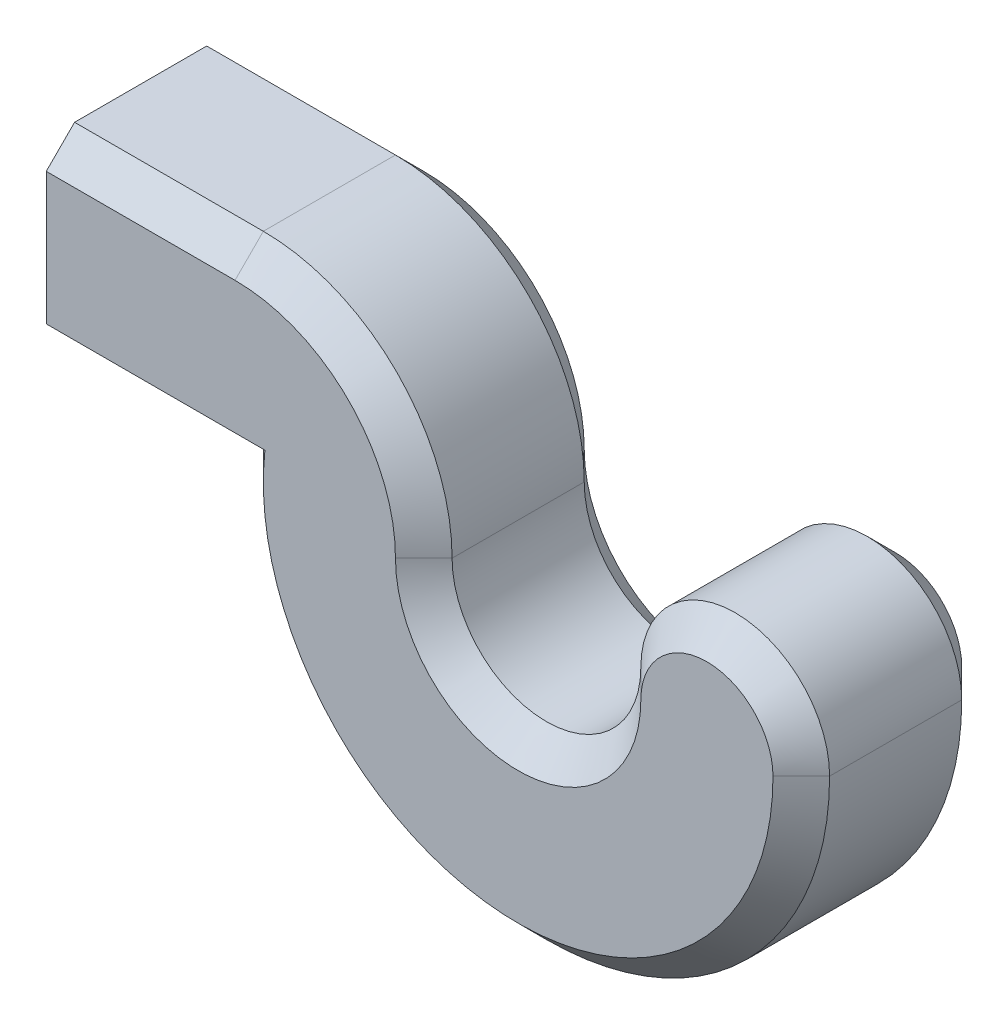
ISO-10303-21;
HEADER;
FILE_DESCRIPTION(('STEP AP214'),'2;1');
FILE_NAME('part.step','',(''),(''),'','','');
FILE_SCHEMA(('AUTOMOTIVE_DESIGN { 1 0 10303 214 1 1 1 1 }'));
ENDSEC;
DATA;
#1=APPLICATION_CONTEXT('core data for automotive mechanical design processes');
#2=APPLICATION_PROTOCOL_DEFINITION('international standard','automotive_design',2000,#1);
#3=PRODUCT_CONTEXT('',#1,'mechanical');
#4=PRODUCT('Part','Part','',(#3));
#5=PRODUCT_RELATED_PRODUCT_CATEGORY('part','',(#4));
#6=PRODUCT_DEFINITION_FORMATION('','',#4);
#7=PRODUCT_DEFINITION_CONTEXT('part definition',#1,'design');
#8=PRODUCT_DEFINITION('design','',#6,#7);
#9=PRODUCT_DEFINITION_SHAPE('','',#8);
#10=(LENGTH_UNIT() NAMED_UNIT(*) SI_UNIT(.MILLI.,.METRE.));
#11=(NAMED_UNIT(*) PLANE_ANGLE_UNIT() SI_UNIT($,.RADIAN.));
#12=(NAMED_UNIT(*) SI_UNIT($,.STERADIAN.) SOLID_ANGLE_UNIT());
#13=UNCERTAINTY_MEASURE_WITH_UNIT(LENGTH_MEASURE(1.E-05),#10,'distance_accuracy_value','');
#14=(GEOMETRIC_REPRESENTATION_CONTEXT(3) GLOBAL_UNCERTAINTY_ASSIGNED_CONTEXT((#13)) GLOBAL_UNIT_ASSIGNED_CONTEXT((#10,
#11,#12)) REPRESENTATION_CONTEXT('',''));
#15=CARTESIAN_POINT('',(0.,0.,0.));
#16=DIRECTION('',(0.,0.,1.));
#17=DIRECTION('',(1.,0.,0.));
#18=AXIS2_PLACEMENT_3D('',#15,#16,#17);
#19=CARTESIAN_POINT('',(0.,0.,2.));
#20=DIRECTION('',(0.,1.,0.));
#21=DIRECTION('',(0.,0.,1.));
#22=AXIS2_PLACEMENT_3D('',#19,#20,#21);
#23=PLANE('',#22);
#24=DIRECTION('',(0.,0.,-1.));
#25=VECTOR('',#24,1.);
#26=CARTESIAN_POINT('',(4.00000000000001,0.,2.));
#27=LINE('',#26,#25);
#28=CARTESIAN_POINT('',(4.00000000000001,0.,1.4));
#29=VERTEX_POINT('',#28);
#30=CARTESIAN_POINT('',(4.00000000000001,0.,-1.4));
#31=VERTEX_POINT('',#30);
#32=EDGE_CURVE('E151',#29,#31,#27,.T.);
#33=ORIENTED_EDGE('',*,*,#32,.F.);
#34=DIRECTION('',(-1.,0.,0.));
#35=VECTOR('',#34,1.);
#36=CARTESIAN_POINT('',(0.,0.,1.4));
#37=LINE('',#36,#35);
#38=CARTESIAN_POINT('',(0.,0.,1.4));
#39=VERTEX_POINT('',#38);
#40=EDGE_CURVE('E330',#29,#39,#37,.T.);
#41=ORIENTED_EDGE('',*,*,#40,.T.);
#42=DIRECTION('',(0.,0.,-1.));
#43=VECTOR('',#42,1.);
#44=CARTESIAN_POINT('',(0.,0.,2.));
#45=LINE('',#44,#43);
#46=CARTESIAN_POINT('',(0.,0.,-1.4));
#47=VERTEX_POINT('',#46);
#48=EDGE_CURVE('E161',#39,#47,#45,.T.);
#49=ORIENTED_EDGE('',*,*,#48,.T.);
#50=DIRECTION('',(1.,0.,0.));
#51=VECTOR('',#50,1.);
#52=CARTESIAN_POINT('',(0.,0.,-1.4));
#53=LINE('',#52,#51);
#54=EDGE_CURVE('E327',#47,#31,#53,.T.);
#55=ORIENTED_EDGE('',*,*,#54,.T.);
#56=EDGE_LOOP('',(#33,#41,#49,#55));
#57=FACE_BOUND('',#56,.T.);
#58=ADVANCED_FACE('F38',(#57),#23,.F.);
#59=CARTESIAN_POINT('',(10.,0.,2.));
#60=DIRECTION('',(0.,0.,-1.));
#61=DIRECTION('',(-1.,0.,0.));
#62=AXIS2_PLACEMENT_3D('',#59,#60,#61);
#63=CYLINDRICAL_SURFACE('',#62,6.);
#64=DIRECTION('',(0.,0.,-1.));
#65=VECTOR('',#64,1.);
#66=CARTESIAN_POINT('',(16.,0.,2.));
#67=LINE('',#66,#65);
#68=CARTESIAN_POINT('',(16.,0.,1.4));
#69=VERTEX_POINT('',#68);
#70=CARTESIAN_POINT('',(16.,0.,-1.4));
#71=VERTEX_POINT('',#70);
#72=EDGE_CURVE('E313',#69,#71,#67,.T.);
#73=ORIENTED_EDGE('',*,*,#72,.F.);
#74=CARTESIAN_POINT('',(10.,0.,1.4));
#75=DIRECTION('',(0.,0.,1.));
#76=DIRECTION('',(1.,0.,0.));
#77=AXIS2_PLACEMENT_3D('',#74,#75,#76);
#78=CIRCLE('',#77,6.);
#79=EDGE_CURVE('E176',#69,#29,#78,.F.);
#80=ORIENTED_EDGE('',*,*,#79,.T.);
#81=ORIENTED_EDGE('',*,*,#32,.T.);
#82=CARTESIAN_POINT('',(10.,0.,-1.4));
#83=DIRECTION('',(0.,0.,1.));
#84=DIRECTION('',(1.,0.,0.));
#85=AXIS2_PLACEMENT_3D('',#82,#83,#84);
#86=CIRCLE('',#85,6.);
#87=EDGE_CURVE('E169',#31,#71,#86,.T.);
#88=ORIENTED_EDGE('',*,*,#87,.T.);
#89=EDGE_LOOP('',(#73,#80,#81,#88));
#90=FACE_BOUND('',#89,.T.);
#91=ADVANCED_FACE('F357',(#90),#63,.T.);
#92=CARTESIAN_POINT('',(14.,0.,2.));
#93=DIRECTION('',(0.,0.,-1.));
#94=DIRECTION('',(-1.,0.,0.));
#95=AXIS2_PLACEMENT_3D('',#92,#93,#94);
#96=CYLINDRICAL_SURFACE('',#95,2.);
#97=DIRECTION('',(0.,0.,-1.));
#98=VECTOR('',#97,1.);
#99=CARTESIAN_POINT('',(12.,0.,2.));
#100=LINE('',#99,#98);
#101=CARTESIAN_POINT('',(12.,0.,1.4));
#102=VERTEX_POINT('',#101);
#103=CARTESIAN_POINT('',(12.,0.,-1.4));
#104=VERTEX_POINT('',#103);
#105=EDGE_CURVE('E310',#102,#104,#100,.T.);
#106=ORIENTED_EDGE('',*,*,#105,.F.);
#107=CARTESIAN_POINT('',(14.,0.,1.4));
#108=DIRECTION('',(0.,0.,1.));
#109=DIRECTION('',(1.,0.,0.));
#110=AXIS2_PLACEMENT_3D('',#107,#108,#109);
#111=CIRCLE('',#110,2.);
#112=EDGE_CURVE('E180',#102,#69,#111,.F.);
#113=ORIENTED_EDGE('',*,*,#112,.T.);
#114=ORIENTED_EDGE('',*,*,#72,.T.);
#115=CARTESIAN_POINT('',(14.,0.,-1.4));
#116=DIRECTION('',(0.,0.,1.));
#117=DIRECTION('',(1.,0.,0.));
#118=AXIS2_PLACEMENT_3D('',#115,#116,#117);
#119=CIRCLE('',#118,2.);
#120=EDGE_CURVE('E178',#71,#104,#119,.T.);
#121=ORIENTED_EDGE('',*,*,#120,.T.);
#122=EDGE_LOOP('',(#106,#113,#114,#121));
#123=FACE_BOUND('',#122,.T.);
#124=ADVANCED_FACE('F361',(#123),#96,.T.);
#125=CARTESIAN_POINT('',(10.,0.,2.));
#126=DIRECTION('',(0.,0.,-1.));
#127=DIRECTION('',(-1.,0.,0.));
#128=AXIS2_PLACEMENT_3D('',#125,#126,#127);
#129=CYLINDRICAL_SURFACE('',#128,2.);
#130=DIRECTION('',(0.,0.,-1.));
#131=VECTOR('',#130,1.);
#132=CARTESIAN_POINT('',(8.00000000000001,0.,2.));
#133=LINE('',#132,#131);
#134=CARTESIAN_POINT('',(8.00000000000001,0.,1.4));
#135=VERTEX_POINT('',#134);
#136=CARTESIAN_POINT('',(8.00000000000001,0.,-1.4));
#137=VERTEX_POINT('',#136);
#138=EDGE_CURVE('E302',#135,#137,#133,.T.);
#139=ORIENTED_EDGE('',*,*,#138,.F.);
#140=CARTESIAN_POINT('',(10.,0.,1.4));
#141=DIRECTION('',(0.,0.,1.));
#142=DIRECTION('',(1.,0.,0.));
#143=AXIS2_PLACEMENT_3D('',#140,#141,#142);
#144=CIRCLE('',#143,2.);
#145=EDGE_CURVE('E184',#135,#102,#144,.T.);
#146=ORIENTED_EDGE('',*,*,#145,.T.);
#147=ORIENTED_EDGE('',*,*,#105,.T.);
#148=CARTESIAN_POINT('',(10.,0.,-1.4));
#149=DIRECTION('',(0.,0.,1.));
#150=DIRECTION('',(1.,0.,0.));
#151=AXIS2_PLACEMENT_3D('',#148,#149,#150);
#152=CIRCLE('',#151,2.);
#153=EDGE_CURVE('E182',#104,#137,#152,.F.);
#154=ORIENTED_EDGE('',*,*,#153,.T.);
#155=EDGE_LOOP('',(#139,#146,#147,#154));
#156=FACE_BOUND('',#155,.T.);
#157=ADVANCED_FACE('F379',(#156),#129,.F.);
#158=CARTESIAN_POINT('',(4.00000000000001,0.,2.));
#159=DIRECTION('',(0.,0.,-1.));
#160=DIRECTION('',(-1.,0.,0.));
#161=AXIS2_PLACEMENT_3D('',#158,#159,#160);
#162=CYLINDRICAL_SURFACE('',#161,4.);
#163=DIRECTION('',(0.,0.,-1.));
#164=VECTOR('',#163,1.);
#165=CARTESIAN_POINT('',(4.00000000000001,4.,2.));
#166=LINE('',#165,#164);
#167=CARTESIAN_POINT('',(4.00000000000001,4.,1.4));
#168=VERTEX_POINT('',#167);
#169=CARTESIAN_POINT('',(4.00000000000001,4.,-1.4));
#170=VERTEX_POINT('',#169);
#171=EDGE_CURVE('E298',#168,#170,#166,.T.);
#172=ORIENTED_EDGE('',*,*,#171,.F.);
#173=CARTESIAN_POINT('',(4.00000000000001,0.,1.4));
#174=DIRECTION('',(0.,0.,1.));
#175=DIRECTION('',(1.,0.,0.));
#176=AXIS2_PLACEMENT_3D('',#173,#174,#175);
#177=CIRCLE('',#176,4.);
#178=EDGE_CURVE('E188',#168,#135,#177,.F.);
#179=ORIENTED_EDGE('',*,*,#178,.T.);
#180=ORIENTED_EDGE('',*,*,#138,.T.);
#181=CARTESIAN_POINT('',(4.00000000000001,0.,-1.4));
#182=DIRECTION('',(0.,0.,1.));
#183=DIRECTION('',(1.,0.,0.));
#184=AXIS2_PLACEMENT_3D('',#181,#182,#183);
#185=CIRCLE('',#184,4.);
#186=EDGE_CURVE('E186',#137,#170,#185,.T.);
#187=ORIENTED_EDGE('',*,*,#186,.T.);
#188=EDGE_LOOP('',(#172,#179,#180,#187));
#189=FACE_BOUND('',#188,.T.);
#190=ADVANCED_FACE('F382',(#189),#162,.T.);
#191=CARTESIAN_POINT('',(0.,4.,2.));
#192=DIRECTION('',(0.,-1.,0.));
#193=DIRECTION('',(1.,0.,0.));
#194=AXIS2_PLACEMENT_3D('',#191,#192,#193);
#195=PLANE('',#194);
#196=DIRECTION('',(0.,0.,-1.));
#197=VECTOR('',#196,1.);
#198=CARTESIAN_POINT('',(0.,4.,2.));
#199=LINE('',#198,#197);
#200=CARTESIAN_POINT('',(0.,4.,1.4));
#201=VERTEX_POINT('',#200);
#202=CARTESIAN_POINT('',(0.,4.,-1.4));
#203=VERTEX_POINT('',#202);
#204=EDGE_CURVE('E296',#201,#203,#199,.T.);
#205=ORIENTED_EDGE('',*,*,#204,.F.);
#206=DIRECTION('',(1.,0.,0.));
#207=VECTOR('',#206,1.);
#208=CARTESIAN_POINT('',(4.00000000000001,4.,1.4));
#209=LINE('',#208,#207);
#210=EDGE_CURVE('E166',#201,#168,#209,.T.);
#211=ORIENTED_EDGE('',*,*,#210,.T.);
#212=ORIENTED_EDGE('',*,*,#171,.T.);
#213=DIRECTION('',(-1.,0.,0.));
#214=VECTOR('',#213,1.);
#215=CARTESIAN_POINT('',(0.,4.,-1.4));
#216=LINE('',#215,#214);
#217=EDGE_CURVE('E190',#170,#203,#216,.T.);
#218=ORIENTED_EDGE('',*,*,#217,.T.);
#219=EDGE_LOOP('',(#205,#211,#212,#218));
#220=FACE_BOUND('',#219,.T.);
#221=ADVANCED_FACE('F295',(#220),#195,.F.);
#222=CARTESIAN_POINT('',(0.,0.,2.));
#223=DIRECTION('',(1.,0.,0.));
#224=DIRECTION('',(0.,0.,-1.));
#225=AXIS2_PLACEMENT_3D('',#222,#223,#224);
#226=PLANE('',#225);
#227=ORIENTED_EDGE('',*,*,#48,.F.);
#228=DIRECTION('',(0.,0.707106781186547,0.707106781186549));
#229=VECTOR('',#228,1.);
#230=CARTESIAN_POINT('',(0.,0.6,2.));
#231=LINE('',#230,#229);
#232=CARTESIAN_POINT('',(0.,0.6,2.));
#233=VERTEX_POINT('',#232);
#234=EDGE_CURVE('E160',#39,#233,#231,.T.);
#235=ORIENTED_EDGE('',*,*,#234,.T.);
#236=DIRECTION('',(0.,-1.,0.));
#237=VECTOR('',#236,1.);
#238=CARTESIAN_POINT('',(0.,0.,2.));
#239=LINE('',#238,#237);
#240=CARTESIAN_POINT('',(0.,3.4,2.));
#241=VERTEX_POINT('',#240);
#242=EDGE_CURVE('E143',#241,#233,#239,.T.);
#243=ORIENTED_EDGE('',*,*,#242,.F.);
#244=DIRECTION('',(0.,0.707106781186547,-0.707106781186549));
#245=VECTOR('',#244,1.);
#246=CARTESIAN_POINT('',(0.,3.4,2.));
#247=LINE('',#246,#245);
#248=EDGE_CURVE('E157',#241,#201,#247,.T.);
#249=ORIENTED_EDGE('',*,*,#248,.T.);
#250=ORIENTED_EDGE('',*,*,#204,.T.);
#251=DIRECTION('',(0.,0.707106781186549,0.707106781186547));
#252=VECTOR('',#251,1.);
#253=CARTESIAN_POINT('',(0.,4.,-1.4));
#254=LINE('',#253,#252);
#255=CARTESIAN_POINT('',(0.,3.4,-2.));
#256=VERTEX_POINT('',#255);
#257=EDGE_CURVE('E171',#203,#256,#254,.F.);
#258=ORIENTED_EDGE('',*,*,#257,.T.);
#259=DIRECTION('',(0.,-1.,0.));
#260=VECTOR('',#259,1.);
#261=CARTESIAN_POINT('',(0.,0.,-2.));
#262=LINE('',#261,#260);
#263=CARTESIAN_POINT('',(0.,0.600000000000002,-2.));
#264=VERTEX_POINT('',#263);
#265=EDGE_CURVE('E162',#256,#264,#262,.T.);
#266=ORIENTED_EDGE('',*,*,#265,.T.);
#267=DIRECTION('',(0.,0.707106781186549,-0.707106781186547));
#268=VECTOR('',#267,1.);
#269=CARTESIAN_POINT('',(0.,0.,-1.4));
#270=LINE('',#269,#268);
#271=EDGE_CURVE('E167',#264,#47,#270,.F.);
#272=ORIENTED_EDGE('',*,*,#271,.T.);
#273=EDGE_LOOP('',(#227,#235,#243,#249,#250,#258,#266,#272));
#274=FACE_BOUND('',#273,.T.);
#275=ADVANCED_FACE('F155',(#274),#226,.F.);
#276=CARTESIAN_POINT('',(10.,0.,2.));
#277=DIRECTION('',(0.,0.,1.));
#278=DIRECTION('',(1.,0.,0.));
#279=AXIS2_PLACEMENT_3D('',#276,#277,#278);
#280=PLANE('',#279);
#281=ORIENTED_EDGE('',*,*,#242,.T.);
#282=DIRECTION('',(1.,0.,0.));
#283=VECTOR('',#282,1.);
#284=CARTESIAN_POINT('',(4.00000000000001,0.6,2.));
#285=LINE('',#284,#283);
#286=CARTESIAN_POINT('',(4.63343685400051,0.6,2.));
#287=VERTEX_POINT('',#286);
#288=EDGE_CURVE('E325',#233,#287,#285,.T.);
#289=ORIENTED_EDGE('',*,*,#288,.T.);
#290=CARTESIAN_POINT('',(10.,0.,2.));
#291=DIRECTION('',(0.,0.,1.));
#292=DIRECTION('',(1.,0.,0.));
#293=AXIS2_PLACEMENT_3D('',#290,#291,#292);
#294=CIRCLE('',#293,5.4);
#295=CARTESIAN_POINT('',(15.4,0.,2.));
#296=VERTEX_POINT('',#295);
#297=EDGE_CURVE('E323',#287,#296,#294,.T.);
#298=ORIENTED_EDGE('',*,*,#297,.T.);
#299=CARTESIAN_POINT('',(14.,0.,2.));
#300=DIRECTION('',(0.,0.,1.));
#301=DIRECTION('',(1.,0.,0.));
#302=AXIS2_PLACEMENT_3D('',#299,#300,#301);
#303=CIRCLE('',#302,1.4);
#304=CARTESIAN_POINT('',(12.6,0.,2.));
#305=VERTEX_POINT('',#304);
#306=EDGE_CURVE('E321',#296,#305,#303,.T.);
#307=ORIENTED_EDGE('',*,*,#306,.T.);
#308=CARTESIAN_POINT('',(10.,0.,2.));
#309=DIRECTION('',(0.,0.,1.));
#310=DIRECTION('',(1.,0.,0.));
#311=AXIS2_PLACEMENT_3D('',#308,#309,#310);
#312=CIRCLE('',#311,2.6);
#313=CARTESIAN_POINT('',(7.40000000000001,0.,2.));
#314=VERTEX_POINT('',#313);
#315=EDGE_CURVE('E319',#305,#314,#312,.F.);
#316=ORIENTED_EDGE('',*,*,#315,.T.);
#317=CARTESIAN_POINT('',(4.00000000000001,0.,2.));
#318=DIRECTION('',(0.,0.,1.));
#319=DIRECTION('',(1.,0.,0.));
#320=AXIS2_PLACEMENT_3D('',#317,#318,#319);
#321=CIRCLE('',#320,3.4);
#322=CARTESIAN_POINT('',(4.00000000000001,3.4,2.));
#323=VERTEX_POINT('',#322);
#324=EDGE_CURVE('E146',#314,#323,#321,.T.);
#325=ORIENTED_EDGE('',*,*,#324,.T.);
#326=DIRECTION('',(-1.,0.,0.));
#327=VECTOR('',#326,1.);
#328=CARTESIAN_POINT('',(0.,3.4,2.));
#329=LINE('',#328,#327);
#330=EDGE_CURVE('E139',#323,#241,#329,.T.);
#331=ORIENTED_EDGE('',*,*,#330,.T.);
#332=EDGE_LOOP('',(#281,#289,#298,#307,#316,#325,#331));
#333=FACE_BOUND('',#332,.T.);
#334=ADVANCED_FACE('F141',(#333),#280,.T.);
#335=CARTESIAN_POINT('',(10.,0.,-2.));
#336=DIRECTION('',(0.,0.,1.));
#337=DIRECTION('',(1.,0.,0.));
#338=AXIS2_PLACEMENT_3D('',#335,#336,#337);
#339=PLANE('',#338);
#340=CARTESIAN_POINT('',(10.,0.,-2.));
#341=DIRECTION('',(0.,0.,1.));
#342=DIRECTION('',(1.,0.,0.));
#343=AXIS2_PLACEMENT_3D('',#340,#341,#342);
#344=CIRCLE('',#343,5.4);
#345=CARTESIAN_POINT('',(15.4,0.,-2.));
#346=VERTEX_POINT('',#345);
#347=CARTESIAN_POINT('',(4.63343685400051,0.600000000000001,-2.));
#348=VERTEX_POINT('',#347);
#349=EDGE_CURVE('E48',#346,#348,#344,.F.);
#350=ORIENTED_EDGE('',*,*,#349,.T.);
#351=DIRECTION('',(-1.,0.,0.));
#352=VECTOR('',#351,1.);
#353=CARTESIAN_POINT('',(10.,0.600000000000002,-2.));
#354=LINE('',#353,#352);
#355=EDGE_CURVE('E11',#348,#264,#354,.T.);
#356=ORIENTED_EDGE('',*,*,#355,.T.);
#357=ORIENTED_EDGE('',*,*,#265,.F.);
#358=DIRECTION('',(1.,0.,0.));
#359=VECTOR('',#358,1.);
#360=CARTESIAN_POINT('',(10.,3.4,-2.));
#361=LINE('',#360,#359);
#362=CARTESIAN_POINT('',(4.00000000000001,3.4,-2.));
#363=VERTEX_POINT('',#362);
#364=EDGE_CURVE('E193',#256,#363,#361,.T.);
#365=ORIENTED_EDGE('',*,*,#364,.T.);
#366=CARTESIAN_POINT('',(4.00000000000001,0.,-2.));
#367=DIRECTION('',(0.,0.,1.));
#368=DIRECTION('',(1.,0.,0.));
#369=AXIS2_PLACEMENT_3D('',#366,#367,#368);
#370=CIRCLE('',#369,3.4);
#371=CARTESIAN_POINT('',(7.40000000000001,0.,-2.));
#372=VERTEX_POINT('',#371);
#373=EDGE_CURVE('E195',#363,#372,#370,.F.);
#374=ORIENTED_EDGE('',*,*,#373,.T.);
#375=CARTESIAN_POINT('',(10.,0.,-2.));
#376=DIRECTION('',(0.,0.,1.));
#377=DIRECTION('',(1.,0.,0.));
#378=AXIS2_PLACEMENT_3D('',#375,#376,#377);
#379=CIRCLE('',#378,2.6);
#380=CARTESIAN_POINT('',(12.6,0.,-2.));
#381=VERTEX_POINT('',#380);
#382=EDGE_CURVE('E197',#372,#381,#379,.T.);
#383=ORIENTED_EDGE('',*,*,#382,.T.);
#384=CARTESIAN_POINT('',(14.,0.,-2.));
#385=DIRECTION('',(0.,0.,1.));
#386=DIRECTION('',(1.,0.,0.));
#387=AXIS2_PLACEMENT_3D('',#384,#385,#386);
#388=CIRCLE('',#387,1.4);
#389=EDGE_CURVE('E59',#381,#346,#388,.F.);
#390=ORIENTED_EDGE('',*,*,#389,.T.);
#391=EDGE_LOOP('',(#350,#356,#357,#365,#374,#383,#390));
#392=FACE_BOUND('',#391,.T.);
#393=ADVANCED_FACE('F249',(#392),#339,.F.);
#394=CARTESIAN_POINT('',(10.,3.4,2.));
#395=DIRECTION('',(0.,0.707106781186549,0.707106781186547));
#396=DIRECTION('',(1.,0.,0.));
#397=AXIS2_PLACEMENT_3D('',#394,#395,#396);
#398=PLANE('',#397);
#399=ORIENTED_EDGE('',*,*,#248,.F.);
#400=ORIENTED_EDGE('',*,*,#330,.F.);
#401=DIRECTION('',(0.,-0.707106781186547,0.707106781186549));
#402=VECTOR('',#401,1.);
#403=CARTESIAN_POINT('',(4.00000000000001,4.,1.4));
#404=LINE('',#403,#402);
#405=EDGE_CURVE('E271',#168,#323,#404,.T.);
#406=ORIENTED_EDGE('',*,*,#405,.F.);
#407=ORIENTED_EDGE('',*,*,#210,.F.);
#408=EDGE_LOOP('',(#399,#400,#406,#407));
#409=FACE_BOUND('',#408,.T.);
#410=ADVANCED_FACE('F165',(#409),#398,.T.);
#411=CARTESIAN_POINT('',(4.00000000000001,0.,2.));
#412=DIRECTION('',(0.,0.,-1.));
#413=DIRECTION('',(-1.,0.,0.));
#414=AXIS2_PLACEMENT_3D('',#411,#412,#413);
#415=CONICAL_SURFACE('',#414,3.4,0.785398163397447);
#416=ORIENTED_EDGE('',*,*,#405,.T.);
#417=ORIENTED_EDGE('',*,*,#324,.F.);
#418=DIRECTION('',(-0.707106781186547,0.,0.707106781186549));
#419=VECTOR('',#418,1.);
#420=CARTESIAN_POINT('',(8.00000000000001,0.,1.4));
#421=LINE('',#420,#419);
#422=EDGE_CURVE('E348',#135,#314,#421,.T.);
#423=ORIENTED_EDGE('',*,*,#422,.F.);
#424=ORIENTED_EDGE('',*,*,#178,.F.);
#425=EDGE_LOOP('',(#416,#417,#423,#424));
#426=FACE_BOUND('',#425,.T.);
#427=ADVANCED_FACE('F237',(#426),#415,.T.);
#428=CARTESIAN_POINT('',(10.,0.,2.));
#429=DIRECTION('',(0.,0.,1.));
#430=DIRECTION('',(1.,0.,0.));
#431=AXIS2_PLACEMENT_3D('',#428,#429,#430);
#432=CONICAL_SURFACE('',#431,2.6,0.785398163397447);
#433=ORIENTED_EDGE('',*,*,#422,.T.);
#434=ORIENTED_EDGE('',*,*,#315,.F.);
#435=DIRECTION('',(0.707106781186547,0.,0.707106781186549));
#436=VECTOR('',#435,1.);
#437=CARTESIAN_POINT('',(12.,0.,1.4));
#438=LINE('',#437,#436);
#439=EDGE_CURVE('E347',#102,#305,#438,.T.);
#440=ORIENTED_EDGE('',*,*,#439,.F.);
#441=ORIENTED_EDGE('',*,*,#145,.F.);
#442=EDGE_LOOP('',(#433,#434,#440,#441));
#443=FACE_BOUND('',#442,.T.);
#444=ADVANCED_FACE('F230',(#443),#432,.F.);
#445=CARTESIAN_POINT('',(14.,0.,2.));
#446=DIRECTION('',(0.,0.,-1.));
#447=DIRECTION('',(-1.,0.,0.));
#448=AXIS2_PLACEMENT_3D('',#445,#446,#447);
#449=CONICAL_SURFACE('',#448,1.4,0.785398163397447);
#450=ORIENTED_EDGE('',*,*,#439,.T.);
#451=ORIENTED_EDGE('',*,*,#306,.F.);
#452=DIRECTION('',(-0.707106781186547,0.,0.707106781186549));
#453=VECTOR('',#452,1.);
#454=CARTESIAN_POINT('',(16.,0.,1.4));
#455=LINE('',#454,#453);
#456=EDGE_CURVE('E209',#69,#296,#455,.T.);
#457=ORIENTED_EDGE('',*,*,#456,.F.);
#458=ORIENTED_EDGE('',*,*,#112,.F.);
#459=EDGE_LOOP('',(#450,#451,#457,#458));
#460=FACE_BOUND('',#459,.T.);
#461=ADVANCED_FACE('F223',(#460),#449,.T.);
#462=CARTESIAN_POINT('',(10.,0.,2.));
#463=DIRECTION('',(0.,0.,-1.));
#464=DIRECTION('',(-1.,0.,0.));
#465=AXIS2_PLACEMENT_3D('',#462,#463,#464);
#466=CONICAL_SURFACE('',#465,5.4,0.785398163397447);
#467=ORIENTED_EDGE('',*,*,#456,.T.);
#468=ORIENTED_EDGE('',*,*,#297,.F.);
#469=CARTESIAN_POINT('',(4.63343685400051,0.6,2.));
#470=CARTESIAN_POINT('',(4.57870062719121,0.551041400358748,1.95104140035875));
#471=CARTESIAN_POINT('',(4.52447895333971,0.501796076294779,1.90179607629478));
#472=CARTESIAN_POINT('',(4.41703127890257,0.402779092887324,1.80277909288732));
#473=CARTESIAN_POINT('',(4.3638051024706,0.35300752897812,1.75300752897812));
#474=CARTESIAN_POINT('',(4.25829674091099,0.252968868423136,1.65296886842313));
#475=CARTESIAN_POINT('',(4.20601453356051,0.202701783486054,1.60270178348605));
#476=CARTESIAN_POINT('',(4.10234410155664,0.101694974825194,1.50169497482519));
#477=CARTESIAN_POINT('',(4.05095603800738,0.0509551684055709,1.45095516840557));
#478=CARTESIAN_POINT('',(4.00000000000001,0.,1.4));
#479=B_SPLINE_CURVE_WITH_KNOTS('',3,(#469,#470,#471,#472,#473,#474,#475,#476,#477,#478),
.UNSPECIFIED.,.F.,.F.,(4,2,2,2,4),(0.,0.264778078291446,0.529508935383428,0.794233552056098,
1.05900538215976),.UNSPECIFIED.);
#480=EDGE_CURVE('E201',#29,#287,#479,.F.);
#481=ORIENTED_EDGE('',*,*,#480,.F.);
#482=ORIENTED_EDGE('',*,*,#79,.F.);
#483=EDGE_LOOP('',(#467,#468,#481,#482));
#484=FACE_BOUND('',#483,.T.);
#485=ADVANCED_FACE('F216',(#484),#466,.T.);
#486=CARTESIAN_POINT('',(10.,0.6,2.));
#487=DIRECTION('',(0.,-0.707106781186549,0.707106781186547));
#488=DIRECTION('',(-1.,0.,0.));
#489=AXIS2_PLACEMENT_3D('',#486,#487,#488);
#490=PLANE('',#489);
#491=ORIENTED_EDGE('',*,*,#234,.F.);
#492=ORIENTED_EDGE('',*,*,#40,.F.);
#493=ORIENTED_EDGE('',*,*,#480,.T.);
#494=ORIENTED_EDGE('',*,*,#288,.F.);
#495=EDGE_LOOP('',(#491,#492,#493,#494));
#496=FACE_BOUND('',#495,.T.);
#497=ADVANCED_FACE('F212',(#496),#490,.T.);
#498=CARTESIAN_POINT('',(0.,4.,-1.4));
#499=DIRECTION('',(0.,-0.707106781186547,0.707106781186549));
#500=DIRECTION('',(-1.,0.,0.));
#501=AXIS2_PLACEMENT_3D('',#498,#499,#500);
#502=PLANE('',#501);
#503=ORIENTED_EDGE('',*,*,#257,.F.);
#504=ORIENTED_EDGE('',*,*,#217,.F.);
#505=DIRECTION('',(0.,0.707106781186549,0.707106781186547));
#506=VECTOR('',#505,1.);
#507=CARTESIAN_POINT('',(4.00000000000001,3.4,-2.));
#508=LINE('',#507,#506);
#509=EDGE_CURVE('E43',#363,#170,#508,.T.);
#510=ORIENTED_EDGE('',*,*,#509,.F.);
#511=ORIENTED_EDGE('',*,*,#364,.F.);
#512=EDGE_LOOP('',(#503,#504,#510,#511));
#513=FACE_BOUND('',#512,.T.);
#514=ADVANCED_FACE('F41',(#513),#502,.F.);
#515=CARTESIAN_POINT('',(4.00000000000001,0.,-1.4));
#516=DIRECTION('',(0.,0.,1.));
#517=DIRECTION('',(1.,0.,0.));
#518=AXIS2_PLACEMENT_3D('',#515,#516,#517);
#519=CONICAL_SURFACE('',#518,4.,0.78539816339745);
#520=ORIENTED_EDGE('',*,*,#509,.T.);
#521=ORIENTED_EDGE('',*,*,#186,.F.);
#522=DIRECTION('',(0.707106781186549,0.,0.707106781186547));
#523=VECTOR('',#522,1.);
#524=CARTESIAN_POINT('',(7.40000000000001,0.,-2.));
#525=LINE('',#524,#523);
#526=EDGE_CURVE('E277',#372,#137,#525,.T.);
#527=ORIENTED_EDGE('',*,*,#526,.F.);
#528=ORIENTED_EDGE('',*,*,#373,.F.);
#529=EDGE_LOOP('',(#520,#521,#527,#528));
#530=FACE_BOUND('',#529,.T.);
#531=ADVANCED_FACE('F288',(#530),#519,.T.);
#532=CARTESIAN_POINT('',(10.,0.,-1.4));
#533=DIRECTION('',(0.,0.,-1.));
#534=DIRECTION('',(-1.,0.,0.));
#535=AXIS2_PLACEMENT_3D('',#532,#533,#534);
#536=CONICAL_SURFACE('',#535,2.,0.78539816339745);
#537=ORIENTED_EDGE('',*,*,#526,.T.);
#538=ORIENTED_EDGE('',*,*,#153,.F.);
#539=DIRECTION('',(-0.707106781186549,0.,0.707106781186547));
#540=VECTOR('',#539,1.);
#541=CARTESIAN_POINT('',(12.6,0.,-2.));
#542=LINE('',#541,#540);
#543=EDGE_CURVE('E275',#381,#104,#542,.T.);
#544=ORIENTED_EDGE('',*,*,#543,.F.);
#545=ORIENTED_EDGE('',*,*,#382,.F.);
#546=EDGE_LOOP('',(#537,#538,#544,#545));
#547=FACE_BOUND('',#546,.T.);
#548=ADVANCED_FACE('F370',(#547),#536,.F.);
#549=CARTESIAN_POINT('',(14.,0.,-1.4));
#550=DIRECTION('',(0.,0.,1.));
#551=DIRECTION('',(1.,0.,0.));
#552=AXIS2_PLACEMENT_3D('',#549,#550,#551);
#553=CONICAL_SURFACE('',#552,2.,0.78539816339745);
#554=ORIENTED_EDGE('',*,*,#543,.T.);
#555=ORIENTED_EDGE('',*,*,#120,.F.);
#556=DIRECTION('',(0.707106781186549,0.,0.707106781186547));
#557=VECTOR('',#556,1.);
#558=CARTESIAN_POINT('',(15.4,0.,-2.));
#559=LINE('',#558,#557);
#560=EDGE_CURVE('E270',#346,#71,#559,.T.);
#561=ORIENTED_EDGE('',*,*,#560,.F.);
#562=ORIENTED_EDGE('',*,*,#389,.F.);
#563=EDGE_LOOP('',(#554,#555,#561,#562));
#564=FACE_BOUND('',#563,.T.);
#565=ADVANCED_FACE('F363',(#564),#553,.T.);
#566=CARTESIAN_POINT('',(10.,0.,-1.4));
#567=DIRECTION('',(0.,0.,1.));
#568=DIRECTION('',(1.,0.,0.));
#569=AXIS2_PLACEMENT_3D('',#566,#567,#568);
#570=CONICAL_SURFACE('',#569,6.,0.78539816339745);
#571=ORIENTED_EDGE('',*,*,#560,.T.);
#572=ORIENTED_EDGE('',*,*,#87,.F.);
#573=CARTESIAN_POINT('',(4.00000000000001,0.,-1.4));
#574=CARTESIAN_POINT('',(4.05095603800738,0.0509551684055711,-1.45095516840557));
#575=CARTESIAN_POINT('',(4.10234410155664,0.101694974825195,-1.50169497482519));
#576=CARTESIAN_POINT('',(4.20601453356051,0.202701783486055,-1.60270178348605));
#577=CARTESIAN_POINT('',(4.25829674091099,0.252968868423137,-1.65296886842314));
#578=CARTESIAN_POINT('',(4.3638051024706,0.353007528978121,-1.75300752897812));
#579=CARTESIAN_POINT('',(4.41703127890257,0.402779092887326,-1.80277909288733));
#580=CARTESIAN_POINT('',(4.52447895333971,0.50179607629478,-1.90179607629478));
#581=CARTESIAN_POINT('',(4.57870062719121,0.55104140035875,-1.95104140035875));
#582=CARTESIAN_POINT('',(4.63343685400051,0.600000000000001,-2.));
#583=B_SPLINE_CURVE_WITH_KNOTS('',3,(#573,#574,#575,#576,#577,#578,#579,#580,#581,#582),
.UNSPECIFIED.,.F.,.F.,(4,2,2,2,4),(0.,0.264771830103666,0.529496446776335,0.794227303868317,
1.05900538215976),.UNSPECIFIED.);
#584=EDGE_CURVE('E263',#348,#31,#583,.F.);
#585=ORIENTED_EDGE('',*,*,#584,.F.);
#586=ORIENTED_EDGE('',*,*,#349,.F.);
#587=EDGE_LOOP('',(#571,#572,#585,#586));
#588=FACE_BOUND('',#587,.T.);
#589=ADVANCED_FACE('F258',(#588),#570,.T.);
#590=CARTESIAN_POINT('',(0.,0.,-1.4));
#591=DIRECTION('',(0.,0.707106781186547,0.707106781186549));
#592=DIRECTION('',(1.,0.,0.));
#593=AXIS2_PLACEMENT_3D('',#590,#591,#592);
#594=PLANE('',#593);
#595=ORIENTED_EDGE('',*,*,#271,.F.);
#596=ORIENTED_EDGE('',*,*,#355,.F.);
#597=ORIENTED_EDGE('',*,*,#584,.T.);
#598=ORIENTED_EDGE('',*,*,#54,.F.);
#599=EDGE_LOOP('',(#595,#596,#597,#598));
#600=FACE_BOUND('',#599,.T.);
#601=ADVANCED_FACE('F251',(#600),#594,.F.);
#602=CLOSED_SHELL('',(#58,#91,#124,#157,#190,#221,#275,#334,#393,#410,#427,#444,#461,#485,#497,
#514,#531,#548,#565,#589,#601));
#603=MANIFOLD_SOLID_BREP('B2',#602);
#604=ADVANCED_BREP_SHAPE_REPRESENTATION('',(#18,#603),#14);
#605=SHAPE_DEFINITION_REPRESENTATION(#9,#604);
ENDSEC;
END-ISO-10303-21;
